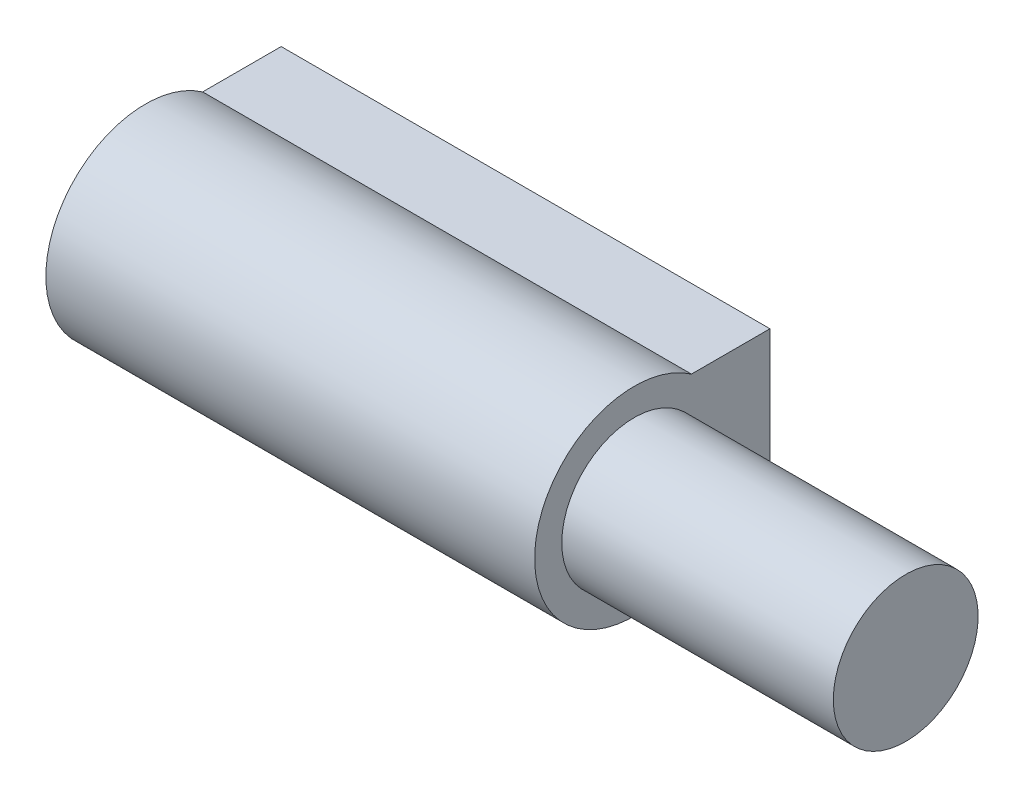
ISO-10303-21;
HEADER;
FILE_DESCRIPTION(('STEP AP214'),'2;1');
FILE_NAME('part.step','',(''),(''),'','','');
FILE_SCHEMA(('AUTOMOTIVE_DESIGN { 1 0 10303 214 1 1 1 1 }'));
ENDSEC;
DATA;
#1=APPLICATION_CONTEXT('core data for automotive mechanical design processes');
#2=APPLICATION_PROTOCOL_DEFINITION('international standard','automotive_design',2000,#1);
#3=PRODUCT_CONTEXT('',#1,'mechanical');
#4=PRODUCT('Part','Part','',(#3));
#5=PRODUCT_RELATED_PRODUCT_CATEGORY('part','',(#4));
#6=PRODUCT_DEFINITION_FORMATION('','',#4);
#7=PRODUCT_DEFINITION_CONTEXT('part definition',#1,'design');
#8=PRODUCT_DEFINITION('design','',#6,#7);
#9=PRODUCT_DEFINITION_SHAPE('','',#8);
#10=(LENGTH_UNIT() NAMED_UNIT(*) SI_UNIT(.MILLI.,.METRE.));
#11=(NAMED_UNIT(*) PLANE_ANGLE_UNIT() SI_UNIT($,.RADIAN.));
#12=(NAMED_UNIT(*) SI_UNIT($,.STERADIAN.) SOLID_ANGLE_UNIT());
#13=UNCERTAINTY_MEASURE_WITH_UNIT(LENGTH_MEASURE(1.E-05),#10,'distance_accuracy_value','');
#14=(GEOMETRIC_REPRESENTATION_CONTEXT(3) GLOBAL_UNCERTAINTY_ASSIGNED_CONTEXT((#13)) GLOBAL_UNIT_ASSIGNED_CONTEXT((#10,
#11,#12)) REPRESENTATION_CONTEXT('',''));
#15=CARTESIAN_POINT('',(0.,0.,0.));
#16=DIRECTION('',(0.,0.,1.));
#17=DIRECTION('',(1.,0.,0.));
#18=AXIS2_PLACEMENT_3D('',#15,#16,#17);
#19=CARTESIAN_POINT('',(21.,0.,7.5));
#20=DIRECTION('',(-1.,0.,0.));
#21=DIRECTION('',(0.,0.,-1.));
#22=AXIS2_PLACEMENT_3D('',#19,#20,#21);
#23=PLANE('',#22);
#24=DIRECTION('',(0.,0.,-1.));
#25=VECTOR('',#24,1.);
#26=CARTESIAN_POINT('',(21.,4.5,4.51503768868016));
#27=LINE('',#26,#25);
#28=CARTESIAN_POINT('',(21.,4.5,4.3377223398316));
#29=VERTEX_POINT('',#28);
#30=CARTESIAN_POINT('',(21.,4.5,0.));
#31=VERTEX_POINT('',#30);
#32=EDGE_CURVE('E82',#29,#31,#27,.T.);
#33=ORIENTED_EDGE('',*,*,#32,.F.);
#34=CARTESIAN_POINT('',(21.,0.,7.5));
#35=DIRECTION('',(-1.,0.,0.));
#36=DIRECTION('',(0.,0.,-1.));
#37=AXIS2_PLACEMENT_3D('',#34,#35,#36);
#38=CIRCLE('',#37,5.5);
#39=CARTESIAN_POINT('',(21.,-4.5,4.33772233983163));
#40=VERTEX_POINT('',#39);
#41=EDGE_CURVE('E61',#40,#29,#38,.T.);
#42=ORIENTED_EDGE('',*,*,#41,.F.);
#43=DIRECTION('',(0.,0.,-1.));
#44=VECTOR('',#43,1.);
#45=CARTESIAN_POINT('',(21.,-4.5,4.51503768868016));
#46=LINE('',#45,#44);
#47=CARTESIAN_POINT('',(21.,-4.5,0.));
#48=VERTEX_POINT('',#47);
#49=EDGE_CURVE('E65',#40,#48,#46,.T.);
#50=ORIENTED_EDGE('',*,*,#49,.T.);
#51=DIRECTION('',(0.,1.,0.));
#52=VECTOR('',#51,1.);
#53=CARTESIAN_POINT('',(21.,-4.5,0.));
#54=LINE('',#53,#52);
#55=EDGE_CURVE('E79',#48,#31,#54,.T.);
#56=ORIENTED_EDGE('',*,*,#55,.T.);
#57=EDGE_LOOP('',(#33,#42,#50,#56));
#58=FACE_BOUND('',#57,.T.);
#59=CARTESIAN_POINT('',(21.,0.,7.5));
#60=DIRECTION('',(1.,0.,0.));
#61=DIRECTION('',(0.,0.,1.));
#62=AXIS2_PLACEMENT_3D('',#59,#60,#61);
#63=CIRCLE('',#62,4.);
#64=CARTESIAN_POINT('',(21.,0.,11.5));
#65=VERTEX_POINT('',#64);
#66=EDGE_CURVE('E9',#65,#65,#63,.T.);
#67=ORIENTED_EDGE('',*,*,#66,.F.);
#68=EDGE_LOOP('',(#67));
#69=FACE_BOUND('',#68,.T.);
#70=ADVANCED_FACE('F14',(#58,#69),#23,.F.);
#71=CARTESIAN_POINT('',(-6.,4.5,4.51503768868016));
#72=DIRECTION('',(0.,-1.,0.));
#73=DIRECTION('',(0.,0.,1.));
#74=AXIS2_PLACEMENT_3D('',#71,#72,#73);
#75=PLANE('',#74);
#76=DIRECTION('',(0.,0.,-1.));
#77=VECTOR('',#76,1.);
#78=CARTESIAN_POINT('',(-6.,4.5,4.51503768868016));
#79=LINE('',#78,#77);
#80=CARTESIAN_POINT('',(-6.,4.5,4.3377223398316));
#81=VERTEX_POINT('',#80);
#82=CARTESIAN_POINT('',(-6.,4.5,0.));
#83=VERTEX_POINT('',#82);
#84=EDGE_CURVE('E74',#81,#83,#79,.T.);
#85=ORIENTED_EDGE('',*,*,#84,.F.);
#86=DIRECTION('',(-1.,0.,0.));
#87=VECTOR('',#86,1.);
#88=CARTESIAN_POINT('',(21.,4.5,4.3377223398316));
#89=LINE('',#88,#87);
#90=EDGE_CURVE('E59',#29,#81,#89,.T.);
#91=ORIENTED_EDGE('',*,*,#90,.F.);
#92=ORIENTED_EDGE('',*,*,#32,.T.);
#93=DIRECTION('',(1.,0.,0.));
#94=VECTOR('',#93,1.);
#95=CARTESIAN_POINT('',(-6.,4.5,0.));
#96=LINE('',#95,#94);
#97=EDGE_CURVE('E18',#83,#31,#96,.T.);
#98=ORIENTED_EDGE('',*,*,#97,.F.);
#99=EDGE_LOOP('',(#85,#91,#92,#98));
#100=FACE_BOUND('',#99,.T.);
#101=ADVANCED_FACE('F16',(#100),#75,.F.);
#102=CARTESIAN_POINT('',(-6.,-4.5,0.));
#103=DIRECTION('',(0.,0.,-1.));
#104=DIRECTION('',(0.,-1.,0.));
#105=AXIS2_PLACEMENT_3D('',#102,#103,#104);
#106=PLANE('',#105);
#107=CARTESIAN_POINT('',(0.,0.,0.));
#108=DIRECTION('',(0.,0.,-1.));
#109=DIRECTION('',(0.,-1.,0.));
#110=AXIS2_PLACEMENT_3D('',#107,#108,#109);
#111=CIRCLE('',#110,2.65);
#112=CARTESIAN_POINT('',(0.,-2.65,0.));
#113=VERTEX_POINT('',#112);
#114=EDGE_CURVE('E90',#113,#113,#111,.T.);
#115=ORIENTED_EDGE('',*,*,#114,.F.);
#116=EDGE_LOOP('',(#115));
#117=FACE_BOUND('',#116,.T.);
#118=CARTESIAN_POINT('',(15.,0.,0.));
#119=DIRECTION('',(0.,0.,-1.));
#120=DIRECTION('',(0.,-1.,0.));
#121=AXIS2_PLACEMENT_3D('',#118,#119,#120);
#122=CIRCLE('',#121,2.65);
#123=CARTESIAN_POINT('',(15.,-2.65,0.));
#124=VERTEX_POINT('',#123);
#125=EDGE_CURVE('E86',#124,#124,#122,.T.);
#126=ORIENTED_EDGE('',*,*,#125,.F.);
#127=EDGE_LOOP('',(#126));
#128=FACE_BOUND('',#127,.T.);
#129=DIRECTION('',(1.,0.,0.));
#130=VECTOR('',#129,1.);
#131=CARTESIAN_POINT('',(-6.,-4.5,0.));
#132=LINE('',#131,#130);
#133=CARTESIAN_POINT('',(-6.,-4.5,0.));
#134=VERTEX_POINT('',#133);
#135=EDGE_CURVE('E72',#134,#48,#132,.T.);
#136=ORIENTED_EDGE('',*,*,#135,.F.);
#137=DIRECTION('',(0.,1.,0.));
#138=VECTOR('',#137,1.);
#139=CARTESIAN_POINT('',(-6.,-4.5,0.));
#140=LINE('',#139,#138);
#141=EDGE_CURVE('E71',#134,#83,#140,.T.);
#142=ORIENTED_EDGE('',*,*,#141,.T.);
#143=ORIENTED_EDGE('',*,*,#97,.T.);
#144=ORIENTED_EDGE('',*,*,#55,.F.);
#145=EDGE_LOOP('',(#136,#142,#143,#144));
#146=FACE_BOUND('',#145,.T.);
#147=ADVANCED_FACE('F158',(#117,#128,#146),#106,.T.);
#148=CARTESIAN_POINT('',(-6.,-4.5,4.51503768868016));
#149=DIRECTION('',(0.,-1.,0.));
#150=DIRECTION('',(-1.,0.,0.));
#151=AXIS2_PLACEMENT_3D('',#148,#149,#150);
#152=PLANE('',#151);
#153=DIRECTION('',(-1.,0.,0.));
#154=VECTOR('',#153,1.);
#155=CARTESIAN_POINT('',(21.,-4.5,4.33772233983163));
#156=LINE('',#155,#154);
#157=CARTESIAN_POINT('',(-6.,-4.5,4.33772233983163));
#158=VERTEX_POINT('',#157);
#159=EDGE_CURVE('E56',#40,#158,#156,.T.);
#160=ORIENTED_EDGE('',*,*,#159,.T.);
#161=DIRECTION('',(0.,0.,-1.));
#162=VECTOR('',#161,1.);
#163=CARTESIAN_POINT('',(-6.,-4.5,4.51503768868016));
#164=LINE('',#163,#162);
#165=EDGE_CURVE('E37',#158,#134,#164,.T.);
#166=ORIENTED_EDGE('',*,*,#165,.T.);
#167=ORIENTED_EDGE('',*,*,#135,.T.);
#168=ORIENTED_EDGE('',*,*,#49,.F.);
#169=EDGE_LOOP('',(#160,#166,#167,#168));
#170=FACE_BOUND('',#169,.T.);
#171=ADVANCED_FACE('F64',(#170),#152,.T.);
#172=CARTESIAN_POINT('',(-6.,0.,7.5));
#173=DIRECTION('',(-1.,0.,0.));
#174=DIRECTION('',(0.,0.,-1.));
#175=AXIS2_PLACEMENT_3D('',#172,#173,#174);
#176=PLANE('',#175);
#177=ORIENTED_EDGE('',*,*,#165,.F.);
#178=CARTESIAN_POINT('',(-6.,0.,7.5));
#179=DIRECTION('',(-1.,0.,0.));
#180=DIRECTION('',(0.,0.,-1.));
#181=AXIS2_PLACEMENT_3D('',#178,#179,#180);
#182=CIRCLE('',#181,5.5);
#183=EDGE_CURVE('E30',#158,#81,#182,.T.);
#184=ORIENTED_EDGE('',*,*,#183,.T.);
#185=ORIENTED_EDGE('',*,*,#84,.T.);
#186=ORIENTED_EDGE('',*,*,#141,.F.);
#187=EDGE_LOOP('',(#177,#184,#185,#186));
#188=FACE_BOUND('',#187,.T.);
#189=ADVANCED_FACE('F69',(#188),#176,.T.);
#190=CARTESIAN_POINT('',(36.,0.,7.5));
#191=DIRECTION('',(-1.,0.,0.));
#192=DIRECTION('',(0.,0.,-1.));
#193=AXIS2_PLACEMENT_3D('',#190,#191,#192);
#194=CYLINDRICAL_SURFACE('',#193,4.);
#195=CARTESIAN_POINT('',(36.,0.,7.5));
#196=DIRECTION('',(1.,0.,0.));
#197=DIRECTION('',(0.,0.,1.));
#198=AXIS2_PLACEMENT_3D('',#195,#196,#197);
#199=CIRCLE('',#198,4.);
#200=CARTESIAN_POINT('',(36.,0.,11.5));
#201=VERTEX_POINT('',#200);
#202=EDGE_CURVE('E84',#201,#201,#199,.T.);
#203=ORIENTED_EDGE('',*,*,#202,.F.);
#204=EDGE_LOOP('',(#203));
#205=FACE_BOUND('',#204,.T.);
#206=ORIENTED_EDGE('',*,*,#66,.T.);
#207=EDGE_LOOP('',(#206));
#208=FACE_BOUND('',#207,.T.);
#209=ADVANCED_FACE('F164',(#205,#208),#194,.T.);
#210=CARTESIAN_POINT('',(36.,0.,7.5));
#211=DIRECTION('',(1.,0.,0.));
#212=DIRECTION('',(0.,0.,1.));
#213=AXIS2_PLACEMENT_3D('',#210,#211,#212);
#214=PLANE('',#213);
#215=ORIENTED_EDGE('',*,*,#202,.T.);
#216=EDGE_LOOP('',(#215));
#217=FACE_BOUND('',#216,.T.);
#218=ADVANCED_FACE('F169',(#217),#214,.T.);
#219=CARTESIAN_POINT('',(15.,0.,7.5));
#220=DIRECTION('',(0.,0.,-1.));
#221=DIRECTION('',(0.,-1.,0.));
#222=AXIS2_PLACEMENT_3D('',#219,#220,#221);
#223=CYLINDRICAL_SURFACE('',#222,2.65);
#224=CARTESIAN_POINT('',(15.,0.,7.5));
#225=DIRECTION('',(0.,0.,-1.));
#226=DIRECTION('',(0.,-1.,0.));
#227=AXIS2_PLACEMENT_3D('',#224,#225,#226);
#228=CIRCLE('',#227,2.65);
#229=CARTESIAN_POINT('',(15.,-2.64999999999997,7.50000000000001));
#230=VERTEX_POINT('',#229);
#231=EDGE_CURVE('E93',#230,#230,#228,.F.);
#232=ORIENTED_EDGE('',*,*,#231,.T.);
#233=EDGE_LOOP('',(#232));
#234=FACE_BOUND('',#233,.T.);
#235=ORIENTED_EDGE('',*,*,#125,.T.);
#236=EDGE_LOOP('',(#235));
#237=FACE_BOUND('',#236,.T.);
#238=ADVANCED_FACE('F147',(#234,#237),#223,.F.);
#239=CARTESIAN_POINT('',(0.,0.,7.5));
#240=DIRECTION('',(0.,0.,-1.));
#241=DIRECTION('',(0.,-1.,0.));
#242=AXIS2_PLACEMENT_3D('',#239,#240,#241);
#243=CYLINDRICAL_SURFACE('',#242,2.65);
#244=CARTESIAN_POINT('',(0.,0.,7.5));
#245=DIRECTION('',(0.,0.,-1.));
#246=DIRECTION('',(0.,-1.,0.));
#247=AXIS2_PLACEMENT_3D('',#244,#245,#246);
#248=CIRCLE('',#247,2.65);
#249=CARTESIAN_POINT('',(0.,-2.64999999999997,7.50000000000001));
#250=VERTEX_POINT('',#249);
#251=EDGE_CURVE('E99',#250,#250,#248,.F.);
#252=ORIENTED_EDGE('',*,*,#251,.T.);
#253=EDGE_LOOP('',(#252));
#254=FACE_BOUND('',#253,.T.);
#255=ORIENTED_EDGE('',*,*,#114,.T.);
#256=EDGE_LOOP('',(#255));
#257=FACE_BOUND('',#256,.T.);
#258=ADVANCED_FACE('F138',(#254,#257),#243,.F.);
#259=CARTESIAN_POINT('',(15.,0.,7.5));
#260=DIRECTION('',(0.,0.,-1.));
#261=DIRECTION('',(0.,-1.,0.));
#262=AXIS2_PLACEMENT_3D('',#259,#260,#261);
#263=PLANE('',#262);
#264=CARTESIAN_POINT('',(15.,0.,7.5));
#265=DIRECTION('',(0.,0.,-1.));
#266=DIRECTION('',(0.,-1.,0.));
#267=AXIS2_PLACEMENT_3D('',#264,#265,#266);
#268=CIRCLE('',#267,5.);
#269=CARTESIAN_POINT('',(15.,-4.99999999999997,7.50000000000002));
#270=VERTEX_POINT('',#269);
#271=EDGE_CURVE('E96',#270,#270,#268,.T.);
#272=ORIENTED_EDGE('',*,*,#271,.F.);
#273=EDGE_LOOP('',(#272));
#274=FACE_BOUND('',#273,.T.);
#275=ORIENTED_EDGE('',*,*,#231,.F.);
#276=EDGE_LOOP('',(#275));
#277=FACE_BOUND('',#276,.T.);
#278=ADVANCED_FACE('F136',(#274,#277),#263,.F.);
#279=CARTESIAN_POINT('',(15.,0.,12.901));
#280=DIRECTION('',(0.,0.,-1.));
#281=DIRECTION('',(0.,-1.,0.));
#282=AXIS2_PLACEMENT_3D('',#279,#280,#281);
#283=CYLINDRICAL_SURFACE('',#282,5.);
#284=ORIENTED_EDGE('',*,*,#271,.T.);
#285=EDGE_LOOP('',(#284));
#286=FACE_BOUND('',#285,.T.);
#287=CARTESIAN_POINT('',(15.,-5.,9.53960780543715));
#288=CARTESIAN_POINT('',(14.9315207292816,-4.99999932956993,9.53961045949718));
#289=CARTESIAN_POINT('',(14.8630067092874,-4.99858628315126,9.54308436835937));
#290=CARTESIAN_POINT('',(14.7267395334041,-4.99299476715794,9.55670930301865));
#291=CARTESIAN_POINT('',(14.6589871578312,-4.98881368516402,9.56686663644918));
#292=CARTESIAN_POINT('',(14.4572920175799,-4.97228992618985,9.60645686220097));
#293=CARTESIAN_POINT('',(14.3254231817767,-4.9559684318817,9.64499981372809));
#294=CARTESIAN_POINT('',(14.0998271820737,-4.91930607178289,9.72754082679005));
#295=CARTESIAN_POINT('',(14.0044295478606,-4.90081618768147,9.76811816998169));
#296=CARTESIAN_POINT('',(13.8177818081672,-4.8591651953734,9.85603185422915));
#297=CARTESIAN_POINT('',(13.7265350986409,-4.83600034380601,9.90337360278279));
#298=CARTESIAN_POINT('',(13.5476086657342,-4.78531494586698,10.0027747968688));
#299=CARTESIAN_POINT('',(13.4599395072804,-4.75778252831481,10.0548469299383));
#300=CARTESIAN_POINT('',(13.2879232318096,-4.69862287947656,10.1620867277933));
#301=CARTESIAN_POINT('',(13.2035772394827,-4.66699427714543,10.2172554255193));
#302=CARTESIAN_POINT('',(12.9649409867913,-4.5702121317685,10.378928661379));
#303=CARTESIAN_POINT('',(12.814354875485,-4.50003222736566,10.4879224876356));
#304=CARTESIAN_POINT('',(12.5219599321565,-4.34587306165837,10.7080406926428));
#305=CARTESIAN_POINT('',(12.3801576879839,-4.26188361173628,10.8191665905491));
#306=CARTESIAN_POINT('',(12.105115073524,-4.0800456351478,11.0402952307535));
#307=CARTESIAN_POINT('',(11.9718644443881,-3.98221418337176,11.1502991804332));
#308=CARTESIAN_POINT('',(11.7141432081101,-3.77236515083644,11.3667813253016));
#309=CARTESIAN_POINT('',(11.5896677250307,-3.66035554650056,11.4732614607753));
#310=CARTESIAN_POINT('',(11.2922427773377,-3.36385354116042,11.7307819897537));
#311=CARTESIAN_POINT('',(11.12498801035,-3.17051687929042,11.8784483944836));
#312=CARTESIAN_POINT('',(10.8169109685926,-2.75122344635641,12.153328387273));
#313=CARTESIAN_POINT('',(10.6760425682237,-2.52532484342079,12.2805776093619));
#314=CARTESIAN_POINT('',(10.4533729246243,-2.09158650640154,12.4829848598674));
#315=CARTESIAN_POINT('',(10.3653839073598,-1.88948542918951,12.563473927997));
#316=CARTESIAN_POINT('',(10.2528317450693,-1.5738232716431,12.6667580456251));
#317=CARTESIAN_POINT('',(10.2185459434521,-1.46648519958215,12.6982843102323));
#318=CARTESIAN_POINT('',(10.1569806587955,-1.24819928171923,12.7549682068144));
#319=CARTESIAN_POINT('',(10.1296980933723,-1.13725304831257,12.7801286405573));
#320=CARTESIAN_POINT('',(10.0824513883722,-0.911644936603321,12.8237394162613));
#321=CARTESIAN_POINT('',(10.0625415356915,-0.796962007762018,12.8421399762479));
#322=CARTESIAN_POINT('',(10.0307150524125,-0.565548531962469,12.8715692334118));
#323=CARTESIAN_POINT('',(10.0187984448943,-0.448817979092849,12.8825979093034));
#324=CARTESIAN_POINT('',(10.0032173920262,-0.214380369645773,12.89702026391));
#325=CARTESIAN_POINT('',(9.9995497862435,-0.0966737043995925,12.9004168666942));
#326=CARTESIAN_POINT('',(10.0005383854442,0.138666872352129,12.8995014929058));
#327=CARTESIAN_POINT('',(10.0051938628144,0.256300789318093,12.895190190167));
#328=CARTESIAN_POINT('',(10.021750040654,0.477403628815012,12.8798665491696));
#329=CARTESIAN_POINT('',(10.0327881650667,0.580994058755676,12.8696520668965));
#330=CARTESIAN_POINT('',(10.0611654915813,0.786575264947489,12.8434125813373));
#331=CARTESIAN_POINT('',(10.0785067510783,0.888565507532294,12.8273856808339));
#332=CARTESIAN_POINT('',(10.1395942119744,1.19107645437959,12.7709859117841));
#333=CARTESIAN_POINT('',(10.192418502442,1.38832127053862,12.7222805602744));
#334=CARTESIAN_POINT('',(10.3217955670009,1.77710683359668,12.6034220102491));
#335=CARTESIAN_POINT('',(10.3991961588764,1.96812214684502,12.5325039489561));
#336=CARTESIAN_POINT('',(10.5733003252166,2.33352641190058,12.3738485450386));
#337=CARTESIAN_POINT('',(10.6700128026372,2.50790764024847,12.2861034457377));
#338=CARTESIAN_POINT('',(10.9345017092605,2.92591131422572,12.0478953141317));
#339=CARTESIAN_POINT('',(11.1129483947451,3.15788908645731,11.888672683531));
#340=CARTESIAN_POINT('',(11.4018512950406,3.47475154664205,11.635762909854));
#341=CARTESIAN_POINT('',(11.501899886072,3.57534846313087,11.5489365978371));
#342=CARTESIAN_POINT('',(11.708485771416,3.76639091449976,11.3718501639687));
#343=CARTESIAN_POINT('',(11.8150219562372,3.85683817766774,11.2815906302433));
#344=CARTESIAN_POINT('',(12.0368656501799,4.02990557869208,11.0967074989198));
#345=CARTESIAN_POINT('',(12.1523264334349,4.11227142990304,11.002031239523));
#346=CARTESIAN_POINT('',(12.389456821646,4.26674223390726,10.8120813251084));
#347=CARTESIAN_POINT('',(12.5111264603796,4.3388471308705,10.716807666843));
#348=CARTESIAN_POINT('',(12.7606941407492,4.47275429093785,10.5278444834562));
#349=CARTESIAN_POINT('',(12.8885780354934,4.53457865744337,10.4341519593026));
#350=CARTESIAN_POINT('',(13.1515782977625,4.64799386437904,10.2509480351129));
#351=CARTESIAN_POINT('',(13.2866886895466,4.69959299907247,10.1614332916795));
#352=CARTESIAN_POINT('',(13.5466306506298,4.78579257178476,10.0026383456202));
#353=CARTESIAN_POINT('',(13.6703327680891,4.82175355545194,9.93226639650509));
#354=CARTESIAN_POINT('',(13.9256835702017,4.88498959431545,9.80261876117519));
#355=CARTESIAN_POINT('',(14.0573268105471,4.91227052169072,9.74333558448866));
#356=CARTESIAN_POINT('',(14.3052235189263,4.95278755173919,9.65219735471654));
#357=CARTESIAN_POINT('',(14.4200636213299,4.96765673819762,9.61734211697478));
#358=CARTESIAN_POINT('',(14.6543217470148,4.98941301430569,9.56557094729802));
#359=CARTESIAN_POINT('',(14.7737243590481,4.99632487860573,9.54859934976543));
#360=CARTESIAN_POINT('',(15.0147588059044,5.0014379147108,9.53609641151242));
#361=CARTESIAN_POINT('',(15.1364003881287,4.99957787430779,9.54071573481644));
#362=CARTESIAN_POINT('',(15.3767517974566,4.98724720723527,9.57064956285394));
#363=CARTESIAN_POINT('',(15.4954539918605,4.9767561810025,9.59601309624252));
#364=CARTESIAN_POINT('',(15.7759654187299,4.94221310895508,9.67648333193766));
#365=CARTESIAN_POINT('',(15.9348885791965,4.91431170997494,9.73961574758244));
#366=CARTESIAN_POINT('',(16.2415761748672,4.8459650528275,9.88391079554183));
#367=CARTESIAN_POINT('',(16.3892898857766,4.80546656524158,9.96514951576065));
#368=CARTESIAN_POINT('',(16.680396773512,4.71173091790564,10.1400406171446));
#369=CARTESIAN_POINT('',(16.8234540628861,4.65809501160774,10.2340296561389));
#370=CARTESIAN_POINT('',(17.1014899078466,4.53944894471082,10.426817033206));
#371=CARTESIAN_POINT('',(17.2364610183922,4.47442851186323,10.5256196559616));
#372=CARTESIAN_POINT('',(17.4994153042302,4.33303851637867,10.7248622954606));
#373=CARTESIAN_POINT('',(17.627387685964,4.25665206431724,10.8253045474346));
#374=CARTESIAN_POINT('',(17.8764031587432,4.09249677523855,11.0253679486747));
#375=CARTESIAN_POINT('',(17.997448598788,4.0047318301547,11.1249893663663));
#376=CARTESIAN_POINT('',(18.2410164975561,3.81074458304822,11.3287630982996));
#377=CARTESIAN_POINT('',(18.3630081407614,3.70364484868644,11.4327192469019));
#378=CARTESIAN_POINT('',(18.598137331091,3.47566248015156,11.6355857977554));
#379=CARTESIAN_POINT('',(18.7112720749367,3.35477551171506,11.7344945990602));
#380=CARTESIAN_POINT('',(18.9270169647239,3.09941235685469,11.9248044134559));
#381=CARTESIAN_POINT('',(19.0296622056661,2.96498468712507,12.0162302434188));
#382=CARTESIAN_POINT('',(19.2230621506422,2.68236342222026,12.1896080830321));
#383=CARTESIAN_POINT('',(19.3138262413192,2.53418085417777,12.2715675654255));
#384=CARTESIAN_POINT('',(19.5000137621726,2.18997894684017,12.4404720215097));
#385=CARTESIAN_POINT('',(19.592048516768,1.99061780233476,12.5245286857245));
#386=CARTESIAN_POINT('',(19.711124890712,1.67861346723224,12.6336587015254));
#387=CARTESIAN_POINT('',(19.7476599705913,1.57242832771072,12.6672147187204));
#388=CARTESIAN_POINT('',(19.8138758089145,1.35622896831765,12.7281191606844));
#389=CARTESIAN_POINT('',(19.8435598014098,1.24621658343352,12.7554705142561));
#390=CARTESIAN_POINT('',(19.8957707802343,1.0221398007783,12.8036279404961));
#391=CARTESIAN_POINT('',(19.9182393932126,0.908050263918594,12.824380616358));
#392=CARTESIAN_POINT('',(19.9552524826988,0.6775594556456,12.8585890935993));
#393=CARTESIAN_POINT('',(19.9698006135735,0.561159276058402,12.8720482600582));
#394=CARTESIAN_POINT('',(19.9906786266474,0.327014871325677,12.8913687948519));
#395=CARTESIAN_POINT('',(19.9970099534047,0.209270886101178,12.8972314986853));
#396=CARTESIAN_POINT('',(20.0013195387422,-0.0264940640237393,12.9012217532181));
#397=CARTESIAN_POINT('',(19.9992985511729,-0.144515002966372,12.899350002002));
#398=CARTESIAN_POINT('',(19.9876192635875,-0.366988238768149,12.8885379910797));
#399=CARTESIAN_POINT('',(19.9788123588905,-0.471524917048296,12.8803857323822));
#400=CARTESIAN_POINT('',(19.9547557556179,-0.679224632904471,12.8581325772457));
#401=CARTESIAN_POINT('',(19.9395040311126,-0.78238722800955,12.844029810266));
#402=CARTESIAN_POINT('',(19.8844296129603,-1.08869654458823,12.7931509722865));
#403=CARTESIAN_POINT('',(19.8352768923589,-1.28885864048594,12.7477943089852));
#404=CARTESIAN_POINT('',(19.7135414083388,-1.68100623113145,12.6358433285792));
#405=CARTESIAN_POINT('',(19.6404310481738,-1.87268558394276,12.5687712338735));
#406=CARTESIAN_POINT('',(19.4746805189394,-2.24006789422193,12.4174822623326));
#407=CARTESIAN_POINT('',(19.3820304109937,-2.41576265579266,12.3332566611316));
#408=CARTESIAN_POINT('',(19.1292134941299,-2.83481186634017,12.1050021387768));
#409=CARTESIAN_POINT('',(18.9586423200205,-3.0672617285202,11.9523136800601));
#410=CARTESIAN_POINT('',(18.681754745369,-3.38594432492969,11.7087309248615));
#411=CARTESIAN_POINT('',(18.5857777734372,-3.48731563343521,11.6249612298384));
#412=CARTESIAN_POINT('',(18.3874281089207,-3.68027808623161,11.4537515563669));
#413=CARTESIAN_POINT('',(18.2850563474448,-3.77187064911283,11.3663121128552));
#414=CARTESIAN_POINT('',(18.0719012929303,-3.94752707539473,11.1868930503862));
#415=CARTESIAN_POINT('',(17.9609744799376,-4.0313554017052,11.0948547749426));
#416=CARTESIAN_POINT('',(17.733180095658,-4.18914359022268,10.9096720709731));
#417=CARTESIAN_POINT('',(17.6163123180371,-4.26310310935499,10.8165276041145));
#418=CARTESIAN_POINT('',(17.3766542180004,-4.40120789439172,10.6309304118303));
#419=CARTESIAN_POINT('',(17.2538709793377,-4.46536453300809,10.5384770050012));
#420=CARTESIAN_POINT('',(17.0017270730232,-4.58393849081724,10.3564457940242));
#421=CARTESIAN_POINT('',(16.8723701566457,-4.63836128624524,10.266866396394));
#422=CARTESIAN_POINT('',(16.6041170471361,-4.73788748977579,10.0927940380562));
#423=CARTESIAN_POINT('',(16.465118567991,-4.782860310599,10.0083825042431));
#424=CARTESIAN_POINT('',(16.1772061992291,-4.86172987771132,9.8518520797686));
#425=CARTESIAN_POINT('',(16.0283034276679,-4.8956387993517,9.77971971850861));
#426=CARTESIAN_POINT('',(15.759372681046,-4.94336034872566,9.67385968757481));
#427=CARTESIAN_POINT('',(15.6419400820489,-4.96010762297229,9.63502230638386));
#428=CARTESIAN_POINT('',(15.4017959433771,-4.98527403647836,9.57560510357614));
#429=CARTESIAN_POINT('',(15.2791085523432,-4.99372773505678,9.55494955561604));
#430=CARTESIAN_POINT('',(15.1297183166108,-4.99838517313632,9.54356153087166));
#431=CARTESIAN_POINT('',(15.10380248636,-4.99898990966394,9.54208222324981));
#432=CARTESIAN_POINT('',(15.0519261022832,-4.99979744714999,9.54010486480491));
#433=CARTESIAN_POINT('',(15.0259655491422,-5.00000025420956,9.53960679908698));
#434=CARTESIAN_POINT('',(15.,-5.,9.53960780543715));
#435=B_SPLINE_CURVE_WITH_KNOTS('',3,(#287,#288,#289,#290,#291,#292,#293,#294,#295,#296,#297,
#298,#299,#300,#301,#302,#303,#304,#305,#306,#307,#308,#309,#310,#311,#312,#313,#314,#315,#316,
#317,#318,#319,#320,#321,#322,#323,#324,#325,#326,#327,#328,#329,#330,#331,#332,#333,#334,#335,
#336,#337,#338,#339,#340,#341,#342,#343,#344,#345,#346,#347,#348,#349,#350,#351,#352,#353,#354,
#355,#356,#357,#358,#359,#360,#361,#362,#363,#364,#365,#366,#367,#368,#369,#370,#371,#372,#373,
#374,#375,#376,#377,#378,#379,#380,#381,#382,#383,#384,#385,#386,#387,#388,#389,#390,#391,#392,
#393,#394,#395,#396,#397,#398,#399,#400,#401,#402,#403,#404,#405,#406,#407,#408,#409,#410,#411,
#412,#413,#414,#415,#416,#417,#418,#419,#420,#421,#422,#423,#424,#425,#426,#427,#428,#429,#430,
#431,#432,#433,#434),.UNSPECIFIED.,.T.,.F.,(4,2,2,2,2,2,2,2,2,2,2,2,2,2,2,2,2,2,2,2,2,2,2,2,2,2,
2,2,2,2,2,2,2,2,2,2,2,2,2,2,2,2,2,2,2,2,2,2,2,2,2,2,2,2,2,2,2,2,2,2,2,2,2,2,2,2,2,2,2,2,2,2,2,
4),(0.,0.20539557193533,0.410985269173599,0.82367230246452,1.13919884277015,1.45497904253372,
1.77163273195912,2.08839268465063,2.68364927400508,3.27934702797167,3.8743162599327,
4.46895224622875,5.35136707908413,6.23222467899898,6.93312998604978,7.28378186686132,
7.63427914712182,7.987308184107,8.34033824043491,8.69323301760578,9.04609694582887,
9.3597505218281,9.67350656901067,10.3004705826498,10.9519742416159,11.6037789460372,
12.5973942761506,13.0960860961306,13.5946928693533,14.1058486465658,14.617007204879,
15.127052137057,15.6366816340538,16.076458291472,16.5159367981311,16.8774434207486,
17.2378214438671,17.600717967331,17.9644746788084,18.4813424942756,19.0004247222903,
19.5378061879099,20.0756750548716,20.614351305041,21.1528437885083,21.7304323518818,
22.3082029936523,22.883972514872,23.4592843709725,24.1615026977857,24.5127569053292,
24.8638449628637,25.2177057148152,25.571403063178,25.9250382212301,26.2786414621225,
26.5939244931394,26.909306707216,27.5394952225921,28.1846166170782,28.8300669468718,
29.8030284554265,30.2911239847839,30.7791486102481,31.2789712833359,31.7788113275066,
32.2780670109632,32.7770409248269,33.2825125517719,33.7874260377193,34.1606781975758,
34.5323683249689,34.6102501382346,34.6881307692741),.UNSPECIFIED.);
#436=CARTESIAN_POINT('',(15.,-5.,9.53960780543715));
#437=VERTEX_POINT('',#436);
#438=EDGE_CURVE('E105',#437,#437,#435,.T.);
#439=ORIENTED_EDGE('',*,*,#438,.F.);
#440=EDGE_LOOP('',(#439));
#441=FACE_BOUND('',#440,.T.);
#442=ADVANCED_FACE('F117',(#286,#441),#283,.F.);
#443=CARTESIAN_POINT('',(0.,0.,7.5));
#444=DIRECTION('',(0.,0.,-1.));
#445=DIRECTION('',(0.,-1.,0.));
#446=AXIS2_PLACEMENT_3D('',#443,#444,#445);
#447=PLANE('',#446);
#448=CARTESIAN_POINT('',(0.,0.,7.5));
#449=DIRECTION('',(0.,0.,-1.));
#450=DIRECTION('',(0.,-1.,0.));
#451=AXIS2_PLACEMENT_3D('',#448,#449,#450);
#452=CIRCLE('',#451,5.);
#453=CARTESIAN_POINT('',(0.,-4.99999999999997,7.50000000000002));
#454=VERTEX_POINT('',#453);
#455=EDGE_CURVE('E102',#454,#454,#452,.T.);
#456=ORIENTED_EDGE('',*,*,#455,.F.);
#457=EDGE_LOOP('',(#456));
#458=FACE_BOUND('',#457,.T.);
#459=ORIENTED_EDGE('',*,*,#251,.F.);
#460=EDGE_LOOP('',(#459));
#461=FACE_BOUND('',#460,.T.);
#462=ADVANCED_FACE('F128',(#458,#461),#447,.F.);
#463=CARTESIAN_POINT('',(0.,0.,12.901));
#464=DIRECTION('',(0.,0.,-1.));
#465=DIRECTION('',(0.,-1.,0.));
#466=AXIS2_PLACEMENT_3D('',#463,#464,#465);
#467=CYLINDRICAL_SURFACE('',#466,5.);
#468=ORIENTED_EDGE('',*,*,#455,.T.);
#469=EDGE_LOOP('',(#468));
#470=FACE_BOUND('',#469,.T.);
#471=CARTESIAN_POINT('',(0.,-5.,9.53960780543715));
#472=CARTESIAN_POINT('',(-0.0684792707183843,-4.99999932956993,9.53961045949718));
#473=CARTESIAN_POINT('',(-0.13699329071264,-4.99858628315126,9.54308436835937));
#474=CARTESIAN_POINT('',(-0.273260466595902,-4.99299476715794,9.55670930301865));
#475=CARTESIAN_POINT('',(-0.341012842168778,-4.98881368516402,9.56686663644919));
#476=CARTESIAN_POINT('',(-0.542707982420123,-4.97228992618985,9.60645686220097));
#477=CARTESIAN_POINT('',(-0.674576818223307,-4.9559684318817,9.64499981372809));
#478=CARTESIAN_POINT('',(-0.900172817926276,-4.91930607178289,9.72754082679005));
#479=CARTESIAN_POINT('',(-0.995570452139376,-4.90081618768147,9.76811816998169));
#480=CARTESIAN_POINT('',(-1.18221819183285,-4.8591651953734,9.85603185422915));
#481=CARTESIAN_POINT('',(-1.27346490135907,-4.83600034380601,9.9033736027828));
#482=CARTESIAN_POINT('',(-1.45239133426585,-4.78531494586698,10.0027747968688));
#483=CARTESIAN_POINT('',(-1.54006049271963,-4.75778252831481,10.0548469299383));
#484=CARTESIAN_POINT('',(-1.71207676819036,-4.69862287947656,10.1620867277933));
#485=CARTESIAN_POINT('',(-1.79642276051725,-4.66699427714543,10.2172554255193));
#486=CARTESIAN_POINT('',(-2.03505901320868,-4.57021213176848,10.378928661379));
#487=CARTESIAN_POINT('',(-2.185645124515,-4.50003222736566,10.4879224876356));
#488=CARTESIAN_POINT('',(-2.47804006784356,-4.34587306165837,10.7080406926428));
#489=CARTESIAN_POINT('',(-2.61984231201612,-4.26188361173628,10.8191665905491));
#490=CARTESIAN_POINT('',(-2.89488492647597,-4.0800456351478,11.0402952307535));
#491=CARTESIAN_POINT('',(-3.02813555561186,-3.98221418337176,11.1502991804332));
#492=CARTESIAN_POINT('',(-3.28585679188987,-3.77236515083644,11.3667813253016));
#493=CARTESIAN_POINT('',(-3.41033227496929,-3.66035554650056,11.4732614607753));
#494=CARTESIAN_POINT('',(-3.70775722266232,-3.36385354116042,11.7307819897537));
#495=CARTESIAN_POINT('',(-3.87501198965,-3.17051687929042,11.8784483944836));
#496=CARTESIAN_POINT('',(-4.18308903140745,-2.75122344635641,12.153328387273));
#497=CARTESIAN_POINT('',(-4.32395743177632,-2.52532484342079,12.2805776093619));
#498=CARTESIAN_POINT('',(-4.54662707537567,-2.09158650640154,12.4829848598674));
#499=CARTESIAN_POINT('',(-4.63461609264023,-1.88948542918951,12.563473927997));
#500=CARTESIAN_POINT('',(-4.7471682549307,-1.5738232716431,12.6667580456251));
#501=CARTESIAN_POINT('',(-4.78145405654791,-1.46648519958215,12.6982843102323));
#502=CARTESIAN_POINT('',(-4.84301934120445,-1.24819928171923,12.7549682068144));
#503=CARTESIAN_POINT('',(-4.87030190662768,-1.13725304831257,12.7801286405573));
#504=CARTESIAN_POINT('',(-4.9175486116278,-0.911644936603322,12.8237394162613));
#505=CARTESIAN_POINT('',(-4.93745846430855,-0.796962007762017,12.8421399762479));
#506=CARTESIAN_POINT('',(-4.96928494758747,-0.565548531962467,12.8715692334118));
#507=CARTESIAN_POINT('',(-4.98120155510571,-0.448817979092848,12.8825979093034));
#508=CARTESIAN_POINT('',(-4.99678260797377,-0.214380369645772,12.89702026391));
#509=CARTESIAN_POINT('',(-5.0004502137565,-0.0966737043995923,12.9004168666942));
#510=CARTESIAN_POINT('',(-4.99946161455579,0.138666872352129,12.8995014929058));
#511=CARTESIAN_POINT('',(-4.99480613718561,0.256300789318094,12.895190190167));
#512=CARTESIAN_POINT('',(-4.97824995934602,0.477403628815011,12.8798665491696));
#513=CARTESIAN_POINT('',(-4.96721183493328,0.580994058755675,12.8696520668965));
#514=CARTESIAN_POINT('',(-4.93883450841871,0.786575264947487,12.8434125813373));
#515=CARTESIAN_POINT('',(-4.92149324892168,0.888565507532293,12.8273856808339));
#516=CARTESIAN_POINT('',(-4.86040578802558,1.19107645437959,12.7709859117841));
#517=CARTESIAN_POINT('',(-4.80758149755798,1.38832127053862,12.7222805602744));
#518=CARTESIAN_POINT('',(-4.67820443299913,1.77710683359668,12.6034220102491));
#519=CARTESIAN_POINT('',(-4.60080384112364,1.96812214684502,12.5325039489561));
#520=CARTESIAN_POINT('',(-4.42669967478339,2.33352641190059,12.3738485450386));
#521=CARTESIAN_POINT('',(-4.32998719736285,2.50790764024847,12.2861034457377));
#522=CARTESIAN_POINT('',(-4.06549829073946,2.92591131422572,12.0478953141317));
#523=CARTESIAN_POINT('',(-3.88705160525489,3.15788908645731,11.888672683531));
#524=CARTESIAN_POINT('',(-3.59814870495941,3.47475154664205,11.635762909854));
#525=CARTESIAN_POINT('',(-3.49810011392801,3.57534846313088,11.5489365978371));
#526=CARTESIAN_POINT('',(-3.29151422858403,3.76639091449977,11.3718501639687));
#527=CARTESIAN_POINT('',(-3.18497804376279,3.85683817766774,11.2815906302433));
#528=CARTESIAN_POINT('',(-2.96313434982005,4.02990557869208,11.0967074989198));
#529=CARTESIAN_POINT('',(-2.84767356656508,4.11227142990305,11.002031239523));
#530=CARTESIAN_POINT('',(-2.61054317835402,4.26674223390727,10.8120813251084));
#531=CARTESIAN_POINT('',(-2.48887353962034,4.33884713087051,10.716807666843));
#532=CARTESIAN_POINT('',(-2.23930585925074,4.47275429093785,10.5278444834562));
#533=CARTESIAN_POINT('',(-2.11142196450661,4.53457865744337,10.4341519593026));
#534=CARTESIAN_POINT('',(-1.84842170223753,4.64799386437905,10.2509480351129));
#535=CARTESIAN_POINT('',(-1.71331131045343,4.69959299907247,10.1614332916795));
#536=CARTESIAN_POINT('',(-1.45336934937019,4.78579257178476,10.0026383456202));
#537=CARTESIAN_POINT('',(-1.32966723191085,4.82175355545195,9.93226639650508));
#538=CARTESIAN_POINT('',(-1.07431642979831,4.88498959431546,9.80261876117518));
#539=CARTESIAN_POINT('',(-0.942673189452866,4.91227052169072,9.74333558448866));
#540=CARTESIAN_POINT('',(-0.694776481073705,4.95278755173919,9.65219735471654));
#541=CARTESIAN_POINT('',(-0.579936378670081,4.96765673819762,9.61734211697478));
#542=CARTESIAN_POINT('',(-0.345678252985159,4.9894130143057,9.56557094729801));
#543=CARTESIAN_POINT('',(-0.226275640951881,4.99632487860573,9.54859934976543));
#544=CARTESIAN_POINT('',(0.0147588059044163,5.0014379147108,9.53609641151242));
#545=CARTESIAN_POINT('',(0.136400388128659,4.99957787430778,9.54071573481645));
#546=CARTESIAN_POINT('',(0.37675179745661,4.98724720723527,9.57064956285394));
#547=CARTESIAN_POINT('',(0.495453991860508,4.9767561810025,9.59601309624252));
#548=CARTESIAN_POINT('',(0.775965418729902,4.94221310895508,9.67648333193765));
#549=CARTESIAN_POINT('',(0.934888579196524,4.91431170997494,9.73961574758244));
#550=CARTESIAN_POINT('',(1.24157617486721,4.8459650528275,9.88391079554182));
#551=CARTESIAN_POINT('',(1.38928988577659,4.80546656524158,9.96514951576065));
#552=CARTESIAN_POINT('',(1.68039677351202,4.71173091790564,10.1400406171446));
#553=CARTESIAN_POINT('',(1.82345406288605,4.65809501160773,10.2340296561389));
#554=CARTESIAN_POINT('',(2.10148990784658,4.53944894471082,10.426817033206));
#555=CARTESIAN_POINT('',(2.2364610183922,4.47442851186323,10.5256196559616));
#556=CARTESIAN_POINT('',(2.49941530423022,4.33303851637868,10.7248622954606));
#557=CARTESIAN_POINT('',(2.62738768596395,4.25665206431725,10.8253045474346));
#558=CARTESIAN_POINT('',(2.87640315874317,4.09249677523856,11.0253679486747));
#559=CARTESIAN_POINT('',(2.99744859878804,4.00473183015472,11.1249893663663));
#560=CARTESIAN_POINT('',(3.24101649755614,3.81074458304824,11.3287630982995));
#561=CARTESIAN_POINT('',(3.36300814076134,3.70364484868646,11.4327192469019));
#562=CARTESIAN_POINT('',(3.59813733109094,3.47566248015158,11.6355857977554));
#563=CARTESIAN_POINT('',(3.71127207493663,3.35477551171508,11.7344945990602));
#564=CARTESIAN_POINT('',(3.92701696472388,3.09941235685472,11.9248044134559));
#565=CARTESIAN_POINT('',(4.02966220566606,2.96498468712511,12.0162302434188));
#566=CARTESIAN_POINT('',(4.22306215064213,2.6823634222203,12.1896080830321));
#567=CARTESIAN_POINT('',(4.31382624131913,2.53418085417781,12.2715675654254));
#568=CARTESIAN_POINT('',(4.50001376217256,2.18997894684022,12.4404720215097));
#569=CARTESIAN_POINT('',(4.59204851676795,1.99061780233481,12.5245286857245));
#570=CARTESIAN_POINT('',(4.71112489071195,1.67861346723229,12.6336587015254));
#571=CARTESIAN_POINT('',(4.74765997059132,1.57242832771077,12.6672147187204));
#572=CARTESIAN_POINT('',(4.81387580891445,1.35622896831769,12.7281191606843));
#573=CARTESIAN_POINT('',(4.8435598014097,1.24621658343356,12.7554705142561));
#574=CARTESIAN_POINT('',(4.89577078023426,1.02213980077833,12.8036279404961));
#575=CARTESIAN_POINT('',(4.91823939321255,0.908050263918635,12.824380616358));
#576=CARTESIAN_POINT('',(4.95525248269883,0.677559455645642,12.8585890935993));
#577=CARTESIAN_POINT('',(4.96980061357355,0.561159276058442,12.8720482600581));
#578=CARTESIAN_POINT('',(4.99067862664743,0.327014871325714,12.8913687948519));
#579=CARTESIAN_POINT('',(4.99700995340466,0.209270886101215,12.8972314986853));
#580=CARTESIAN_POINT('',(5.00131953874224,-0.0264940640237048,12.9012217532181));
#581=CARTESIAN_POINT('',(4.99929855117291,-0.144515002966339,12.899350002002));
#582=CARTESIAN_POINT('',(4.98761926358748,-0.366988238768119,12.8885379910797));
#583=CARTESIAN_POINT('',(4.97881235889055,-0.471524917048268,12.8803857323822));
#584=CARTESIAN_POINT('',(4.95475575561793,-0.679224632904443,12.8581325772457));
#585=CARTESIAN_POINT('',(4.93950403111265,-0.782387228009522,12.844029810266));
#586=CARTESIAN_POINT('',(4.88442961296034,-1.0886965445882,12.7931509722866));
#587=CARTESIAN_POINT('',(4.83527689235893,-1.28885864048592,12.7477943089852));
#588=CARTESIAN_POINT('',(4.71354140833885,-1.68100623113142,12.6358433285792));
#589=CARTESIAN_POINT('',(4.64043104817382,-1.87268558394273,12.5687712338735));
#590=CARTESIAN_POINT('',(4.47468051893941,-2.2400678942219,12.4174822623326));
#591=CARTESIAN_POINT('',(4.38203041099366,-2.41576265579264,12.3332566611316));
#592=CARTESIAN_POINT('',(4.12921349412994,-2.83481186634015,12.1050021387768));
#593=CARTESIAN_POINT('',(3.9586423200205,-3.06726172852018,11.9523136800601));
#594=CARTESIAN_POINT('',(3.68175474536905,-3.38594432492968,11.7087309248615));
#595=CARTESIAN_POINT('',(3.58577777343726,-3.48731563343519,11.6249612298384));
#596=CARTESIAN_POINT('',(3.38742810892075,-3.68027808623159,11.4537515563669));
#597=CARTESIAN_POINT('',(3.28505634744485,-3.7718706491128,11.3663121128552));
#598=CARTESIAN_POINT('',(3.07190129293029,-3.9475270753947,11.1868930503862));
#599=CARTESIAN_POINT('',(2.96097447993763,-4.03135540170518,11.0948547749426));
#600=CARTESIAN_POINT('',(2.73318009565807,-4.18914359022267,10.9096720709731));
#601=CARTESIAN_POINT('',(2.61631231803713,-4.26310310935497,10.8165276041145));
#602=CARTESIAN_POINT('',(2.37665421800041,-4.4012078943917,10.6309304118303));
#603=CARTESIAN_POINT('',(2.25387097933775,-4.46536453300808,10.5384770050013));
#604=CARTESIAN_POINT('',(2.00172707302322,-4.58393849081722,10.3564457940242));
#605=CARTESIAN_POINT('',(1.87237015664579,-4.63836128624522,10.266866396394));
#606=CARTESIAN_POINT('',(1.60411704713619,-4.73788748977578,10.0927940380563));
#607=CARTESIAN_POINT('',(1.46511856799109,-4.78286031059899,10.0083825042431));
#608=CARTESIAN_POINT('',(1.17720619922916,-4.86172987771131,9.85185207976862));
#609=CARTESIAN_POINT('',(1.0283034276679,-4.89563879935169,9.77971971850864));
#610=CARTESIAN_POINT('',(0.759372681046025,-4.94336034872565,9.67385968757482));
#611=CARTESIAN_POINT('',(0.641940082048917,-4.96010762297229,9.63502230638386));
#612=CARTESIAN_POINT('',(0.40179594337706,-4.98527403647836,9.57560510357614));
#613=CARTESIAN_POINT('',(0.279108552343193,-4.99372773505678,9.55494955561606));
#614=CARTESIAN_POINT('',(0.129718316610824,-4.99838517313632,9.54356153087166));
#615=CARTESIAN_POINT('',(0.103802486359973,-4.99898990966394,9.54208222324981));
#616=CARTESIAN_POINT('',(0.0519261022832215,-4.99979744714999,9.54010486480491));
#617=CARTESIAN_POINT('',(0.0259655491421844,-5.00000025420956,9.53960679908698));
#618=CARTESIAN_POINT('',(0.,-5.,9.53960780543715));
#619=B_SPLINE_CURVE_WITH_KNOTS('',3,(#471,#472,#473,#474,#475,#476,#477,#478,#479,#480,#481,
#482,#483,#484,#485,#486,#487,#488,#489,#490,#491,#492,#493,#494,#495,#496,#497,#498,#499,#500,
#501,#502,#503,#504,#505,#506,#507,#508,#509,#510,#511,#512,#513,#514,#515,#516,#517,#518,#519,
#520,#521,#522,#523,#524,#525,#526,#527,#528,#529,#530,#531,#532,#533,#534,#535,#536,#537,#538,
#539,#540,#541,#542,#543,#544,#545,#546,#547,#548,#549,#550,#551,#552,#553,#554,#555,#556,#557,
#558,#559,#560,#561,#562,#563,#564,#565,#566,#567,#568,#569,#570,#571,#572,#573,#574,#575,#576,
#577,#578,#579,#580,#581,#582,#583,#584,#585,#586,#587,#588,#589,#590,#591,#592,#593,#594,#595,
#596,#597,#598,#599,#600,#601,#602,#603,#604,#605,#606,#607,#608,#609,#610,#611,#612,#613,#614,
#615,#616,#617,#618),.UNSPECIFIED.,.T.,.F.,(4,2,2,2,2,2,2,2,2,2,2,2,2,2,2,2,2,2,2,2,2,2,2,2,2,2,
2,2,2,2,2,2,2,2,2,2,2,2,2,2,2,2,2,2,2,2,2,2,2,2,2,2,2,2,2,2,2,2,2,2,2,2,2,2,2,2,2,2,2,2,2,2,2,
4),(0.,0.205395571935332,0.410985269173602,0.823672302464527,1.13919884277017,1.45497904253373,
1.77163273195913,2.08839268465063,2.68364927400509,3.27934702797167,3.8743162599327,
4.46895224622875,5.35136707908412,6.23222467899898,6.93312998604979,7.28378186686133,
7.63427914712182,7.98730818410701,8.34033824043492,8.69323301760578,9.04609694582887,
9.3597505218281,9.67350656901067,10.3004705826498,10.9519742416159,11.6037789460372,
12.5973942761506,13.0960860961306,13.5946928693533,14.1058486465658,14.617007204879,
15.127052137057,15.6366816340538,16.076458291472,16.5159367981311,16.8774434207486,
17.2378214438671,17.600717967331,17.9644746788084,18.4813424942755,19.0004247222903,
19.5378061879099,20.0756750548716,20.614351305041,21.1528437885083,21.7304323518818,
22.3082029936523,22.883972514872,23.4592843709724,24.1615026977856,24.5127569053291,
24.8638449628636,25.2177057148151,25.5714030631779,25.9250382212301,26.2786414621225,
26.5939244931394,26.9093067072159,27.5394952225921,28.1846166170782,28.8300669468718,
29.8030284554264,30.2911239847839,30.779148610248,31.2789712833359,31.7788113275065,
32.2780670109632,32.7770409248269,33.2825125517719,33.7874260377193,34.1606781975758,
34.5323683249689,34.6102501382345,34.6881307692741),.UNSPECIFIED.);
#620=CARTESIAN_POINT('',(0.,-5.,9.53960780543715));
#621=VERTEX_POINT('',#620);
#622=EDGE_CURVE('E66',#621,#621,#619,.T.);
#623=ORIENTED_EDGE('',*,*,#622,.F.);
#624=EDGE_LOOP('',(#623));
#625=FACE_BOUND('',#624,.T.);
#626=ADVANCED_FACE('F131',(#470,#625),#467,.F.);
#627=CARTESIAN_POINT('',(21.,0.,7.5));
#628=DIRECTION('',(-1.,0.,0.));
#629=DIRECTION('',(0.,0.,-1.));
#630=AXIS2_PLACEMENT_3D('',#627,#628,#629);
#631=CYLINDRICAL_SURFACE('',#630,5.4);
#632=ORIENTED_EDGE('',*,*,#622,.T.);
#633=EDGE_LOOP('',(#632));
#634=FACE_BOUND('',#633,.T.);
#635=ADVANCED_FACE('F126',(#634),#631,.F.);
#636=ORIENTED_EDGE('',*,*,#438,.T.);
#637=EDGE_LOOP('',(#636));
#638=FACE_BOUND('',#637,.T.);
#639=ADVANCED_FACE('F121',(#638),#631,.F.);
#640=CARTESIAN_POINT('',(21.,0.,7.5));
#641=DIRECTION('',(-1.,0.,0.));
#642=DIRECTION('',(0.,0.,-1.));
#643=AXIS2_PLACEMENT_3D('',#640,#641,#642);
#644=CYLINDRICAL_SURFACE('',#643,5.5);
#645=ORIENTED_EDGE('',*,*,#159,.F.);
#646=ORIENTED_EDGE('',*,*,#41,.T.);
#647=ORIENTED_EDGE('',*,*,#90,.T.);
#648=ORIENTED_EDGE('',*,*,#183,.F.);
#649=EDGE_LOOP('',(#645,#646,#647,#648));
#650=FACE_BOUND('',#649,.T.);
#651=ADVANCED_FACE('F55',(#650),#644,.T.);
#652=CLOSED_SHELL('',(#70,#101,#147,#171,#189,#209,#218,#238,#258,#278,#442,#462,#626,#635,#639,#651));
#653=MANIFOLD_SOLID_BREP('B1',#652);
#654=ADVANCED_BREP_SHAPE_REPRESENTATION('',(#18,#653),#14);
#655=SHAPE_DEFINITION_REPRESENTATION(#9,#654);
ENDSEC;
END-ISO-10303-21;
